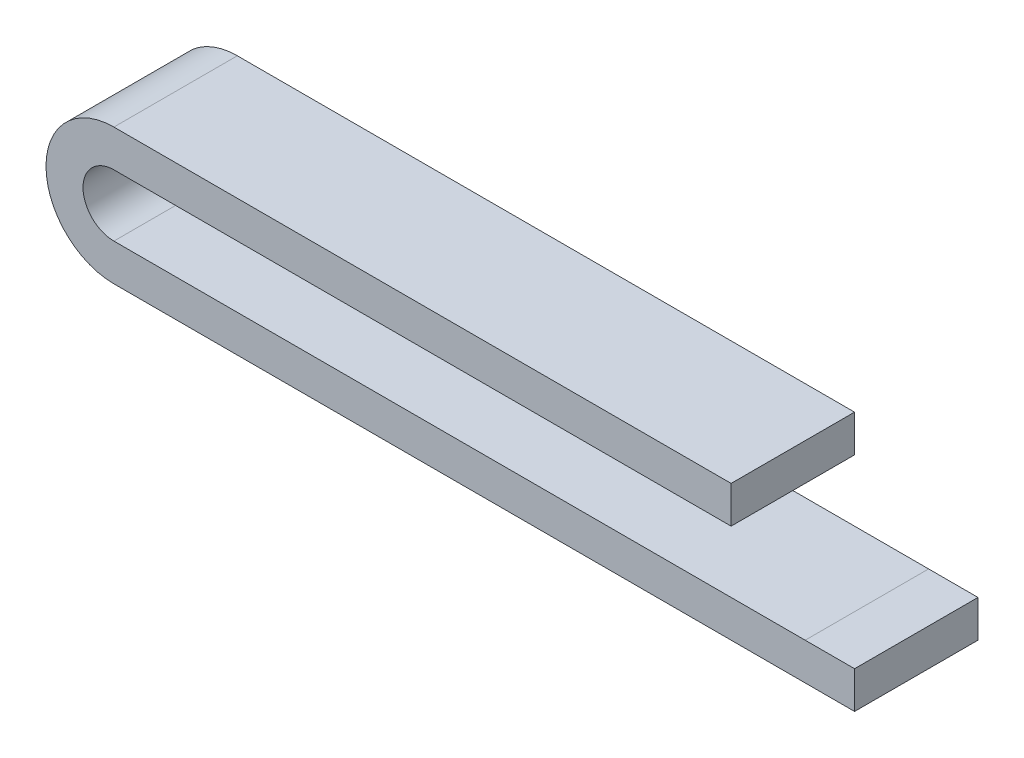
ISO-10303-21;
HEADER;
FILE_DESCRIPTION(('STEP AP214'),'2;1');
FILE_NAME('part.step','',(''),(''),'','','');
FILE_SCHEMA(('AUTOMOTIVE_DESIGN { 1 0 10303 214 1 1 1 1 }'));
ENDSEC;
DATA;
#1=APPLICATION_CONTEXT('core data for automotive mechanical design processes');
#2=APPLICATION_PROTOCOL_DEFINITION('international standard','automotive_design',2000,#1);
#3=PRODUCT_CONTEXT('',#1,'mechanical');
#4=PRODUCT('Part','Part','',(#3));
#5=PRODUCT_RELATED_PRODUCT_CATEGORY('part','',(#4));
#6=PRODUCT_DEFINITION_FORMATION('','',#4);
#7=PRODUCT_DEFINITION_CONTEXT('part definition',#1,'design');
#8=PRODUCT_DEFINITION('design','',#6,#7);
#9=PRODUCT_DEFINITION_SHAPE('','',#8);
#10=(LENGTH_UNIT() NAMED_UNIT(*) SI_UNIT(.MILLI.,.METRE.));
#11=(NAMED_UNIT(*) PLANE_ANGLE_UNIT() SI_UNIT($,.RADIAN.));
#12=(NAMED_UNIT(*) SI_UNIT($,.STERADIAN.) SOLID_ANGLE_UNIT());
#13=UNCERTAINTY_MEASURE_WITH_UNIT(LENGTH_MEASURE(1.E-05),#10,'distance_accuracy_value','');
#14=(GEOMETRIC_REPRESENTATION_CONTEXT(3) GLOBAL_UNCERTAINTY_ASSIGNED_CONTEXT((#13)) GLOBAL_UNIT_ASSIGNED_CONTEXT((#10,
#11,#12)) REPRESENTATION_CONTEXT('',''));
#15=CARTESIAN_POINT('',(0.,0.,0.));
#16=DIRECTION('',(0.,0.,1.));
#17=DIRECTION('',(1.,0.,0.));
#18=AXIS2_PLACEMENT_3D('',#15,#16,#17);
#19=CARTESIAN_POINT('',(0.,0.75,2.5));
#20=DIRECTION('',(0.,1.,0.));
#21=DIRECTION('',(0.,0.,1.));
#22=AXIS2_PLACEMENT_3D('',#19,#20,#21);
#23=PLANE('',#22);
#24=DIRECTION('',(1.,0.,0.));
#25=VECTOR('',#24,1.);
#26=CARTESIAN_POINT('',(0.,0.75,2.5));
#27=LINE('',#26,#25);
#28=CARTESIAN_POINT('',(0.,0.75,2.5));
#29=VERTEX_POINT('',#28);
#30=CARTESIAN_POINT('',(28.,0.75,2.5));
#31=VERTEX_POINT('',#30);
#32=EDGE_CURVE('E140',#29,#31,#27,.T.);
#33=ORIENTED_EDGE('',*,*,#32,.T.);
#34=DIRECTION('',(0.,0.,-1.));
#35=VECTOR('',#34,1.);
#36=CARTESIAN_POINT('',(28.,0.75,2.5));
#37=LINE('',#36,#35);
#38=CARTESIAN_POINT('',(28.,0.75,-2.5));
#39=VERTEX_POINT('',#38);
#40=EDGE_CURVE('E11',#31,#39,#37,.T.);
#41=ORIENTED_EDGE('',*,*,#40,.T.);
#42=DIRECTION('',(1.,0.,0.));
#43=VECTOR('',#42,1.);
#44=CARTESIAN_POINT('',(0.,0.75,-2.5));
#45=LINE('',#44,#43);
#46=CARTESIAN_POINT('',(0.,0.75,-2.5));
#47=VERTEX_POINT('',#46);
#48=EDGE_CURVE('E144',#47,#39,#45,.T.);
#49=ORIENTED_EDGE('',*,*,#48,.F.);
#50=DIRECTION('',(0.,0.,1.));
#51=VECTOR('',#50,1.);
#52=CARTESIAN_POINT('',(0.,0.75,2.5));
#53=LINE('',#52,#51);
#54=EDGE_CURVE('E116',#47,#29,#53,.T.);
#55=ORIENTED_EDGE('',*,*,#54,.T.);
#56=EDGE_LOOP('',(#33,#41,#49,#55));
#57=FACE_BOUND('',#56,.T.);
#58=ADVANCED_FACE('F31',(#57),#23,.T.);
#59=CARTESIAN_POINT('',(0.,-0.750000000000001,2.5));
#60=DIRECTION('',(0.,-1.,0.));
#61=DIRECTION('',(0.,0.,-1.));
#62=AXIS2_PLACEMENT_3D('',#59,#60,#61);
#63=PLANE('',#62);
#64=DIRECTION('',(1.,0.,0.));
#65=VECTOR('',#64,1.);
#66=CARTESIAN_POINT('',(0.,-0.750000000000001,-2.5));
#67=LINE('',#66,#65);
#68=CARTESIAN_POINT('',(0.,-0.750000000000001,-2.5));
#69=VERTEX_POINT('',#68);
#70=CARTESIAN_POINT('',(28.,-0.750000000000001,-2.5));
#71=VERTEX_POINT('',#70);
#72=EDGE_CURVE('E148',#69,#71,#67,.T.);
#73=ORIENTED_EDGE('',*,*,#72,.T.);
#74=DIRECTION('',(0.,0.,1.));
#75=VECTOR('',#74,1.);
#76=CARTESIAN_POINT('',(28.,-0.750000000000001,2.5));
#77=LINE('',#76,#75);
#78=CARTESIAN_POINT('',(28.,-0.750000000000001,2.5));
#79=VERTEX_POINT('',#78);
#80=EDGE_CURVE('E40',#71,#79,#77,.T.);
#81=ORIENTED_EDGE('',*,*,#80,.T.);
#82=DIRECTION('',(1.,0.,0.));
#83=VECTOR('',#82,1.);
#84=CARTESIAN_POINT('',(0.,-0.750000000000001,2.5));
#85=LINE('',#84,#83);
#86=CARTESIAN_POINT('',(0.,-0.750000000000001,2.5));
#87=VERTEX_POINT('',#86);
#88=EDGE_CURVE('E114',#87,#79,#85,.T.);
#89=ORIENTED_EDGE('',*,*,#88,.F.);
#90=DIRECTION('',(0.,0.,-1.));
#91=VECTOR('',#90,1.);
#92=CARTESIAN_POINT('',(0.,-0.750000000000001,2.5));
#93=LINE('',#92,#91);
#94=EDGE_CURVE('E135',#87,#69,#93,.T.);
#95=ORIENTED_EDGE('',*,*,#94,.T.);
#96=EDGE_LOOP('',(#73,#81,#89,#95));
#97=FACE_BOUND('',#96,.T.);
#98=ADVANCED_FACE('F191',(#97),#63,.T.);
#99=CARTESIAN_POINT('',(0.,3.25,2.5));
#100=DIRECTION('',(0.,1.,0.));
#101=DIRECTION('',(0.,0.,1.));
#102=AXIS2_PLACEMENT_3D('',#99,#100,#101);
#103=PLANE('',#102);
#104=DIRECTION('',(0.,0.,1.));
#105=VECTOR('',#104,1.);
#106=CARTESIAN_POINT('',(0.,3.25,2.5));
#107=LINE('',#106,#105);
#108=CARTESIAN_POINT('',(0.,3.25,-2.5));
#109=VERTEX_POINT('',#108);
#110=CARTESIAN_POINT('',(0.,3.25,2.5));
#111=VERTEX_POINT('',#110);
#112=EDGE_CURVE('E153',#109,#111,#107,.T.);
#113=ORIENTED_EDGE('',*,*,#112,.F.);
#114=DIRECTION('',(1.,0.,0.));
#115=VECTOR('',#114,1.);
#116=CARTESIAN_POINT('',(0.,3.25,-2.5));
#117=LINE('',#116,#115);
#118=CARTESIAN_POINT('',(25.,3.25,-2.5));
#119=VERTEX_POINT('',#118);
#120=EDGE_CURVE('E182',#109,#119,#117,.T.);
#121=ORIENTED_EDGE('',*,*,#120,.T.);
#122=DIRECTION('',(0.,0.,1.));
#123=VECTOR('',#122,1.);
#124=CARTESIAN_POINT('',(25.,3.25,2.5));
#125=LINE('',#124,#123);
#126=CARTESIAN_POINT('',(25.,3.25,2.5));
#127=VERTEX_POINT('',#126);
#128=EDGE_CURVE('E174',#119,#127,#125,.T.);
#129=ORIENTED_EDGE('',*,*,#128,.T.);
#130=DIRECTION('',(1.,0.,0.));
#131=VECTOR('',#130,1.);
#132=CARTESIAN_POINT('',(0.,3.25,2.5));
#133=LINE('',#132,#131);
#134=EDGE_CURVE('E185',#111,#127,#133,.T.);
#135=ORIENTED_EDGE('',*,*,#134,.F.);
#136=EDGE_LOOP('',(#113,#121,#129,#135));
#137=FACE_BOUND('',#136,.T.);
#138=ADVANCED_FACE('F33',(#137),#103,.F.);
#139=CARTESIAN_POINT('',(0.,4.75,2.5));
#140=DIRECTION('',(0.,-1.,0.));
#141=DIRECTION('',(0.,0.,-1.));
#142=AXIS2_PLACEMENT_3D('',#139,#140,#141);
#143=PLANE('',#142);
#144=DIRECTION('',(0.,0.,-1.));
#145=VECTOR('',#144,1.);
#146=CARTESIAN_POINT('',(0.,4.75,2.5));
#147=LINE('',#146,#145);
#148=CARTESIAN_POINT('',(0.,4.75,2.5));
#149=VERTEX_POINT('',#148);
#150=CARTESIAN_POINT('',(0.,4.75,-2.5));
#151=VERTEX_POINT('',#150);
#152=EDGE_CURVE('E142',#149,#151,#147,.T.);
#153=ORIENTED_EDGE('',*,*,#152,.F.);
#154=DIRECTION('',(1.,0.,0.));
#155=VECTOR('',#154,1.);
#156=CARTESIAN_POINT('',(0.,4.75,2.5));
#157=LINE('',#156,#155);
#158=CARTESIAN_POINT('',(25.,4.75,2.5));
#159=VERTEX_POINT('',#158);
#160=EDGE_CURVE('E176',#149,#159,#157,.T.);
#161=ORIENTED_EDGE('',*,*,#160,.T.);
#162=DIRECTION('',(0.,0.,-1.));
#163=VECTOR('',#162,1.);
#164=CARTESIAN_POINT('',(25.,4.75,2.5));
#165=LINE('',#164,#163);
#166=CARTESIAN_POINT('',(25.,4.75,-2.5));
#167=VERTEX_POINT('',#166);
#168=EDGE_CURVE('E170',#159,#167,#165,.T.);
#169=ORIENTED_EDGE('',*,*,#168,.T.);
#170=DIRECTION('',(1.,0.,0.));
#171=VECTOR('',#170,1.);
#172=CARTESIAN_POINT('',(0.,4.75,-2.5));
#173=LINE('',#172,#171);
#174=EDGE_CURVE('E179',#151,#167,#173,.T.);
#175=ORIENTED_EDGE('',*,*,#174,.F.);
#176=EDGE_LOOP('',(#153,#161,#169,#175));
#177=FACE_BOUND('',#176,.T.);
#178=ADVANCED_FACE('F210',(#177),#143,.F.);
#179=CARTESIAN_POINT('',(0.,2.,0.));
#180=DIRECTION('',(0.,0.,-1.));
#181=DIRECTION('',(-1.,0.,0.));
#182=AXIS2_PLACEMENT_3D('',#179,#180,#181);
#183=CYLINDRICAL_SURFACE('',#182,1.25);
#184=ORIENTED_EDGE('',*,*,#54,.F.);
#185=CARTESIAN_POINT('',(0.,2.,-2.5));
#186=DIRECTION('',(0.,0.,-1.));
#187=DIRECTION('',(-1.,0.,0.));
#188=AXIS2_PLACEMENT_3D('',#185,#186,#187);
#189=CIRCLE('',#188,1.25);
#190=EDGE_CURVE('E162',#47,#109,#189,.T.);
#191=ORIENTED_EDGE('',*,*,#190,.T.);
#192=ORIENTED_EDGE('',*,*,#112,.T.);
#193=CARTESIAN_POINT('',(0.,2.,2.5));
#194=DIRECTION('',(0.,0.,-1.));
#195=DIRECTION('',(-1.,0.,0.));
#196=AXIS2_PLACEMENT_3D('',#193,#194,#195);
#197=CIRCLE('',#196,1.25);
#198=EDGE_CURVE('E165',#29,#111,#197,.T.);
#199=ORIENTED_EDGE('',*,*,#198,.F.);
#200=EDGE_LOOP('',(#184,#191,#192,#199));
#201=FACE_BOUND('',#200,.T.);
#202=ADVANCED_FACE('F199',(#201),#183,.F.);
#203=CARTESIAN_POINT('',(0.,2.,0.));
#204=DIRECTION('',(0.,0.,-1.));
#205=DIRECTION('',(-1.,0.,0.));
#206=AXIS2_PLACEMENT_3D('',#203,#204,#205);
#207=CYLINDRICAL_SURFACE('',#206,2.75);
#208=ORIENTED_EDGE('',*,*,#94,.F.);
#209=CARTESIAN_POINT('',(0.,2.,2.5));
#210=DIRECTION('',(0.,0.,-1.));
#211=DIRECTION('',(-1.,0.,0.));
#212=AXIS2_PLACEMENT_3D('',#209,#210,#211);
#213=CIRCLE('',#212,2.75);
#214=EDGE_CURVE('E156',#87,#149,#213,.T.);
#215=ORIENTED_EDGE('',*,*,#214,.T.);
#216=ORIENTED_EDGE('',*,*,#152,.T.);
#217=CARTESIAN_POINT('',(0.,2.,-2.5));
#218=DIRECTION('',(0.,0.,-1.));
#219=DIRECTION('',(-1.,0.,0.));
#220=AXIS2_PLACEMENT_3D('',#217,#218,#219);
#221=CIRCLE('',#220,2.75);
#222=EDGE_CURVE('E159',#69,#151,#221,.T.);
#223=ORIENTED_EDGE('',*,*,#222,.F.);
#224=EDGE_LOOP('',(#208,#215,#216,#223));
#225=FACE_BOUND('',#224,.T.);
#226=ADVANCED_FACE('F213',(#225),#207,.T.);
#227=CARTESIAN_POINT('',(0.,0.75,2.5));
#228=DIRECTION('',(0.,0.,1.));
#229=DIRECTION('',(0.,-1.,0.));
#230=AXIS2_PLACEMENT_3D('',#227,#228,#229);
#231=PLANE('',#230);
#232=DIRECTION('',(0.,-1.,0.));
#233=VECTOR('',#232,1.);
#234=CARTESIAN_POINT('',(30.,0.75,2.5));
#235=LINE('',#234,#233);
#236=CARTESIAN_POINT('',(30.,0.75,2.5));
#237=VERTEX_POINT('',#236);
#238=CARTESIAN_POINT('',(30.,-0.750000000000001,2.5));
#239=VERTEX_POINT('',#238);
#240=EDGE_CURVE('E111',#237,#239,#235,.T.);
#241=ORIENTED_EDGE('',*,*,#240,.F.);
#242=EDGE_CURVE('E143',#31,#237,#27,.T.);
#243=ORIENTED_EDGE('',*,*,#242,.F.);
#244=ORIENTED_EDGE('',*,*,#32,.F.);
#245=ORIENTED_EDGE('',*,*,#198,.T.);
#246=ORIENTED_EDGE('',*,*,#134,.T.);
#247=DIRECTION('',(0.,1.,0.));
#248=VECTOR('',#247,1.);
#249=CARTESIAN_POINT('',(25.,3.25,2.5));
#250=LINE('',#249,#248);
#251=EDGE_CURVE('E168',#127,#159,#250,.T.);
#252=ORIENTED_EDGE('',*,*,#251,.T.);
#253=ORIENTED_EDGE('',*,*,#160,.F.);
#254=ORIENTED_EDGE('',*,*,#214,.F.);
#255=ORIENTED_EDGE('',*,*,#88,.T.);
#256=EDGE_CURVE('E107',#79,#239,#85,.T.);
#257=ORIENTED_EDGE('',*,*,#256,.T.);
#258=EDGE_LOOP('',(#241,#243,#244,#245,#246,#252,#253,#254,#255,#257));
#259=FACE_BOUND('',#258,.T.);
#260=ADVANCED_FACE('F109',(#259),#231,.T.);
#261=ORIENTED_EDGE('',*,*,#40,.F.);
#262=ORIENTED_EDGE('',*,*,#242,.T.);
#263=DIRECTION('',(0.,0.,1.));
#264=VECTOR('',#263,1.);
#265=CARTESIAN_POINT('',(30.,0.75,2.5));
#266=LINE('',#265,#264);
#267=CARTESIAN_POINT('',(30.,0.75,-2.5));
#268=VERTEX_POINT('',#267);
#269=EDGE_CURVE('E130',#268,#237,#266,.T.);
#270=ORIENTED_EDGE('',*,*,#269,.F.);
#271=EDGE_CURVE('E147',#39,#268,#45,.T.);
#272=ORIENTED_EDGE('',*,*,#271,.F.);
#273=EDGE_LOOP('',(#261,#262,#270,#272));
#274=FACE_BOUND('',#273,.T.);
#275=ADVANCED_FACE('F195',(#274),#23,.T.);
#276=CARTESIAN_POINT('',(0.,0.75,-2.5));
#277=DIRECTION('',(0.,0.,-1.));
#278=DIRECTION('',(0.,1.,0.));
#279=AXIS2_PLACEMENT_3D('',#276,#277,#278);
#280=PLANE('',#279);
#281=DIRECTION('',(0.,1.,0.));
#282=VECTOR('',#281,1.);
#283=CARTESIAN_POINT('',(30.,0.75,-2.5));
#284=LINE('',#283,#282);
#285=CARTESIAN_POINT('',(30.,-0.750000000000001,-2.5));
#286=VERTEX_POINT('',#285);
#287=EDGE_CURVE('E126',#286,#268,#284,.T.);
#288=ORIENTED_EDGE('',*,*,#287,.F.);
#289=EDGE_CURVE('E122',#71,#286,#67,.T.);
#290=ORIENTED_EDGE('',*,*,#289,.F.);
#291=ORIENTED_EDGE('',*,*,#72,.F.);
#292=ORIENTED_EDGE('',*,*,#222,.T.);
#293=ORIENTED_EDGE('',*,*,#174,.T.);
#294=DIRECTION('',(0.,-1.,0.));
#295=VECTOR('',#294,1.);
#296=CARTESIAN_POINT('',(25.,3.25,-2.5));
#297=LINE('',#296,#295);
#298=EDGE_CURVE('E172',#167,#119,#297,.T.);
#299=ORIENTED_EDGE('',*,*,#298,.T.);
#300=ORIENTED_EDGE('',*,*,#120,.F.);
#301=ORIENTED_EDGE('',*,*,#190,.F.);
#302=ORIENTED_EDGE('',*,*,#48,.T.);
#303=ORIENTED_EDGE('',*,*,#271,.T.);
#304=EDGE_LOOP('',(#288,#290,#291,#292,#293,#299,#300,#301,#302,#303));
#305=FACE_BOUND('',#304,.T.);
#306=ADVANCED_FACE('F194',(#305),#280,.T.);
#307=ORIENTED_EDGE('',*,*,#80,.F.);
#308=ORIENTED_EDGE('',*,*,#289,.T.);
#309=DIRECTION('',(0.,0.,-1.));
#310=VECTOR('',#309,1.);
#311=CARTESIAN_POINT('',(30.,-0.750000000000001,2.5));
#312=LINE('',#311,#310);
#313=EDGE_CURVE('E119',#239,#286,#312,.T.);
#314=ORIENTED_EDGE('',*,*,#313,.F.);
#315=ORIENTED_EDGE('',*,*,#256,.F.);
#316=EDGE_LOOP('',(#307,#308,#314,#315));
#317=FACE_BOUND('',#316,.T.);
#318=ADVANCED_FACE('F120',(#317),#63,.T.);
#319=CARTESIAN_POINT('',(25.,4.75,2.5));
#320=DIRECTION('',(-1.,0.,0.));
#321=DIRECTION('',(0.,0.,-1.));
#322=AXIS2_PLACEMENT_3D('',#319,#320,#321);
#323=PLANE('',#322);
#324=ORIENTED_EDGE('',*,*,#251,.F.);
#325=ORIENTED_EDGE('',*,*,#128,.F.);
#326=ORIENTED_EDGE('',*,*,#298,.F.);
#327=ORIENTED_EDGE('',*,*,#168,.F.);
#328=EDGE_LOOP('',(#324,#325,#326,#327));
#329=FACE_BOUND('',#328,.T.);
#330=ADVANCED_FACE('F207',(#329),#323,.F.);
#331=CARTESIAN_POINT('',(30.,-0.750000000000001,2.5));
#332=DIRECTION('',(1.,0.,0.));
#333=DIRECTION('',(0.,0.,-1.));
#334=AXIS2_PLACEMENT_3D('',#331,#332,#333);
#335=PLANE('',#334);
#336=ORIENTED_EDGE('',*,*,#240,.T.);
#337=ORIENTED_EDGE('',*,*,#313,.T.);
#338=ORIENTED_EDGE('',*,*,#287,.T.);
#339=ORIENTED_EDGE('',*,*,#269,.T.);
#340=EDGE_LOOP('',(#336,#337,#338,#339));
#341=FACE_BOUND('',#340,.T.);
#342=ADVANCED_FACE('F128',(#341),#335,.T.);
#343=CLOSED_SHELL('',(#58,#98,#138,#178,#202,#226,#260,#275,#306,#318,#330,#342));
#344=MANIFOLD_SOLID_BREP('B2',#343);
#345=ADVANCED_BREP_SHAPE_REPRESENTATION('',(#18,#344),#14);
#346=SHAPE_DEFINITION_REPRESENTATION(#9,#345);
ENDSEC;
END-ISO-10303-21;
